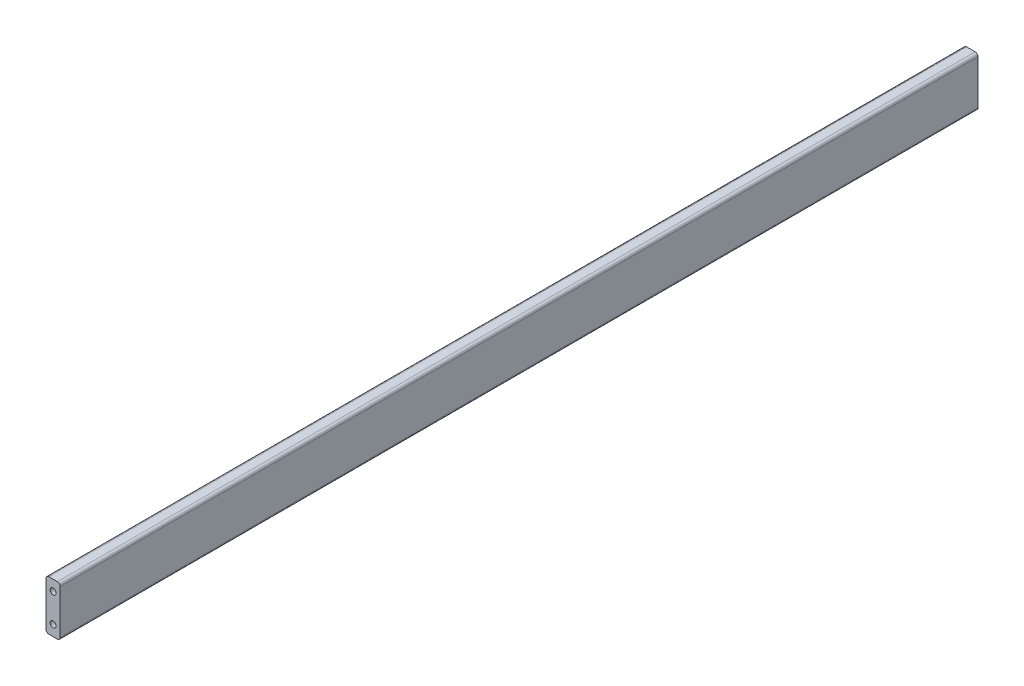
ISO-10303-21;
HEADER;
FILE_DESCRIPTION(('STEP AP214'),'2;1');
FILE_NAME('part.step','',(''),(''),'','','');
FILE_SCHEMA(('AUTOMOTIVE_DESIGN { 1 0 10303 214 1 1 1 1 }'));
ENDSEC;
DATA;
#1=APPLICATION_CONTEXT('core data for automotive mechanical design processes');
#2=APPLICATION_PROTOCOL_DEFINITION('international standard','automotive_design',2000,#1);
#3=PRODUCT_CONTEXT('',#1,'mechanical');
#4=PRODUCT('Part','Part','',(#3));
#5=PRODUCT_RELATED_PRODUCT_CATEGORY('part','',(#4));
#6=PRODUCT_DEFINITION_FORMATION('','',#4);
#7=PRODUCT_DEFINITION_CONTEXT('part definition',#1,'design');
#8=PRODUCT_DEFINITION('design','',#6,#7);
#9=PRODUCT_DEFINITION_SHAPE('','',#8);
#10=(LENGTH_UNIT() NAMED_UNIT(*) SI_UNIT(.MILLI.,.METRE.));
#11=(NAMED_UNIT(*) PLANE_ANGLE_UNIT() SI_UNIT($,.RADIAN.));
#12=(NAMED_UNIT(*) SI_UNIT($,.STERADIAN.) SOLID_ANGLE_UNIT());
#13=UNCERTAINTY_MEASURE_WITH_UNIT(LENGTH_MEASURE(1.E-05),#10,'distance_accuracy_value','');
#14=(GEOMETRIC_REPRESENTATION_CONTEXT(3) GLOBAL_UNCERTAINTY_ASSIGNED_CONTEXT((#13)) GLOBAL_UNIT_ASSIGNED_CONTEXT((#10,
#11,#12)) REPRESENTATION_CONTEXT('',''));
#15=CARTESIAN_POINT('',(0.,0.,0.));
#16=DIRECTION('',(0.,0.,1.));
#17=DIRECTION('',(1.,0.,0.));
#18=AXIS2_PLACEMENT_3D('',#15,#16,#17);
#19=CARTESIAN_POINT('',(0.,10.,308.499999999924));
#20=DIRECTION('',(0.,0.,1.));
#21=DIRECTION('',(1.,0.,0.));
#22=AXIS2_PLACEMENT_3D('',#19,#20,#21);
#23=CONICAL_SURFACE('',#22,2.09999999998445,1.04719755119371);
#24=CARTESIAN_POINT('',(5.6843418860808E-11,10.,307.287564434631));
#25=VERTEX_POINT('',#24);
#26=VERTEX_LOOP('',#25);
#27=FACE_BOUND('',#26,.T.);
#28=CARTESIAN_POINT('',(0.,10.,308.5));
#29=DIRECTION('',(0.,0.,1.));
#30=DIRECTION('',(1.,0.,0.));
#31=AXIS2_PLACEMENT_3D('',#28,#29,#30);
#32=CIRCLE('',#31,2.09999999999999);
#33=CARTESIAN_POINT('',(2.09999999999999,10.,308.5));
#34=VERTEX_POINT('',#33);
#35=EDGE_CURVE('E175',#34,#34,#32,.T.);
#36=ORIENTED_EDGE('',*,*,#35,.T.);
#37=EDGE_LOOP('',(#36));
#38=FACE_BOUND('',#37,.T.);
#39=ADVANCED_FACE('F16',(#27,#38),#23,.F.);
#40=CARTESIAN_POINT('',(0.,-10.,308.499999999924));
#41=DIRECTION('',(0.,0.,1.));
#42=DIRECTION('',(1.,0.,0.));
#43=AXIS2_PLACEMENT_3D('',#40,#41,#42);
#44=CONICAL_SURFACE('',#43,2.09999999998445,1.04719755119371);
#45=CARTESIAN_POINT('',(5.6843418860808E-11,-10.,307.287564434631));
#46=VERTEX_POINT('',#45);
#47=VERTEX_LOOP('',#46);
#48=FACE_BOUND('',#47,.T.);
#49=CARTESIAN_POINT('',(0.,-10.,308.5));
#50=DIRECTION('',(0.,0.,1.));
#51=DIRECTION('',(1.,0.,0.));
#52=AXIS2_PLACEMENT_3D('',#49,#50,#51);
#53=CIRCLE('',#52,2.09999999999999);
#54=CARTESIAN_POINT('',(2.09999999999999,-10.,308.5));
#55=VERTEX_POINT('',#54);
#56=EDGE_CURVE('E172',#55,#55,#53,.T.);
#57=ORIENTED_EDGE('',*,*,#56,.T.);
#58=EDGE_LOOP('',(#57));
#59=FACE_BOUND('',#58,.T.);
#60=ADVANCED_FACE('F351',(#48,#59),#44,.F.);
#61=CARTESIAN_POINT('',(0.,10.,-308.500000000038));
#62=DIRECTION('',(0.,0.,-1.));
#63=DIRECTION('',(-1.,0.,0.));
#64=AXIS2_PLACEMENT_3D('',#61,#62,#63);
#65=CONICAL_SURFACE('',#64,2.10000000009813,1.04719755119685);
#66=CARTESIAN_POINT('',(1.4210854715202E-10,10.,-307.287564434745));
#67=VERTEX_POINT('',#66);
#68=VERTEX_LOOP('',#67);
#69=FACE_BOUND('',#68,.T.);
#70=CARTESIAN_POINT('',(0.,10.,-308.5));
#71=DIRECTION('',(0.,0.,-1.));
#72=DIRECTION('',(-1.,0.,0.));
#73=AXIS2_PLACEMENT_3D('',#70,#71,#72);
#74=CIRCLE('',#73,2.1);
#75=CARTESIAN_POINT('',(-2.1,10.,-308.5));
#76=VERTEX_POINT('',#75);
#77=EDGE_CURVE('E169',#76,#76,#74,.T.);
#78=ORIENTED_EDGE('',*,*,#77,.T.);
#79=EDGE_LOOP('',(#78));
#80=FACE_BOUND('',#79,.T.);
#81=ADVANCED_FACE('F343',(#69,#80),#65,.F.);
#82=CARTESIAN_POINT('',(0.,-10.,-308.500000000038));
#83=DIRECTION('',(0.,0.,-1.));
#84=DIRECTION('',(-1.,0.,0.));
#85=AXIS2_PLACEMENT_3D('',#82,#83,#84);
#86=CONICAL_SURFACE('',#85,2.10000000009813,1.04719755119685);
#87=CARTESIAN_POINT('',(1.4210854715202E-10,-10.,-307.287564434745));
#88=VERTEX_POINT('',#87);
#89=VERTEX_LOOP('',#88);
#90=FACE_BOUND('',#89,.T.);
#91=CARTESIAN_POINT('',(0.,-10.,-308.5));
#92=DIRECTION('',(0.,0.,-1.));
#93=DIRECTION('',(-1.,0.,0.));
#94=AXIS2_PLACEMENT_3D('',#91,#92,#93);
#95=CIRCLE('',#94,2.1);
#96=CARTESIAN_POINT('',(-2.1,-10.,-308.5));
#97=VERTEX_POINT('',#96);
#98=EDGE_CURVE('E165',#97,#97,#95,.T.);
#99=ORIENTED_EDGE('',*,*,#98,.T.);
#100=EDGE_LOOP('',(#99));
#101=FACE_BOUND('',#100,.T.);
#102=ADVANCED_FACE('F332',(#90,#101),#86,.F.);
#103=CARTESIAN_POINT('',(0.,10.,322.5));
#104=DIRECTION('',(0.,0.,1.));
#105=DIRECTION('',(1.,0.,0.));
#106=AXIS2_PLACEMENT_3D('',#103,#104,#105);
#107=CYLINDRICAL_SURFACE('',#106,2.09999999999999);
#108=CARTESIAN_POINT('',(0.,10.,322.5));
#109=DIRECTION('',(0.,0.,1.));
#110=DIRECTION('',(1.,0.,0.));
#111=AXIS2_PLACEMENT_3D('',#108,#109,#110);
#112=CIRCLE('',#111,2.09999999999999);
#113=CARTESIAN_POINT('',(2.09999999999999,10.,322.5));
#114=VERTEX_POINT('',#113);
#115=EDGE_CURVE('E19',#114,#114,#112,.F.);
#116=ORIENTED_EDGE('',*,*,#115,.F.);
#117=EDGE_LOOP('',(#116));
#118=FACE_BOUND('',#117,.T.);
#119=ORIENTED_EDGE('',*,*,#35,.F.);
#120=EDGE_LOOP('',(#119));
#121=FACE_BOUND('',#120,.T.);
#122=ADVANCED_FACE('F322',(#118,#121),#107,.F.);
#123=CARTESIAN_POINT('',(0.,-10.,322.5));
#124=DIRECTION('',(0.,0.,1.));
#125=DIRECTION('',(1.,0.,0.));
#126=AXIS2_PLACEMENT_3D('',#123,#124,#125);
#127=CYLINDRICAL_SURFACE('',#126,2.09999999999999);
#128=CARTESIAN_POINT('',(0.,-10.,322.5));
#129=DIRECTION('',(0.,0.,1.));
#130=DIRECTION('',(1.,0.,0.));
#131=AXIS2_PLACEMENT_3D('',#128,#129,#130);
#132=CIRCLE('',#131,2.09999999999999);
#133=CARTESIAN_POINT('',(2.09999999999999,-10.,322.5));
#134=VERTEX_POINT('',#133);
#135=EDGE_CURVE('E145',#134,#134,#132,.F.);
#136=ORIENTED_EDGE('',*,*,#135,.F.);
#137=EDGE_LOOP('',(#136));
#138=FACE_BOUND('',#137,.T.);
#139=ORIENTED_EDGE('',*,*,#56,.F.);
#140=EDGE_LOOP('',(#139));
#141=FACE_BOUND('',#140,.T.);
#142=ADVANCED_FACE('F312',(#138,#141),#127,.F.);
#143=CARTESIAN_POINT('',(0.,10.,-322.5));
#144=DIRECTION('',(0.,0.,-1.));
#145=DIRECTION('',(-1.,0.,0.));
#146=AXIS2_PLACEMENT_3D('',#143,#144,#145);
#147=CYLINDRICAL_SURFACE('',#146,2.1);
#148=ORIENTED_EDGE('',*,*,#77,.F.);
#149=EDGE_LOOP('',(#148));
#150=FACE_BOUND('',#149,.T.);
#151=CARTESIAN_POINT('',(0.,10.,-322.5));
#152=DIRECTION('',(0.,0.,-1.));
#153=DIRECTION('',(-1.,0.,0.));
#154=AXIS2_PLACEMENT_3D('',#151,#152,#153);
#155=CIRCLE('',#154,2.1);
#156=CARTESIAN_POINT('',(-2.1,10.,-322.5));
#157=VERTEX_POINT('',#156);
#158=EDGE_CURVE('E131',#157,#157,#155,.T.);
#159=ORIENTED_EDGE('',*,*,#158,.T.);
#160=EDGE_LOOP('',(#159));
#161=FACE_BOUND('',#160,.T.);
#162=ADVANCED_FACE('F215',(#150,#161),#147,.F.);
#163=CARTESIAN_POINT('',(0.,-10.,-322.5));
#164=DIRECTION('',(0.,0.,-1.));
#165=DIRECTION('',(-1.,0.,0.));
#166=AXIS2_PLACEMENT_3D('',#163,#164,#165);
#167=CYLINDRICAL_SURFACE('',#166,2.1);
#168=ORIENTED_EDGE('',*,*,#98,.F.);
#169=EDGE_LOOP('',(#168));
#170=FACE_BOUND('',#169,.T.);
#171=CARTESIAN_POINT('',(0.,-10.,-322.5));
#172=DIRECTION('',(0.,0.,-1.));
#173=DIRECTION('',(-1.,0.,0.));
#174=AXIS2_PLACEMENT_3D('',#171,#172,#173);
#175=CIRCLE('',#174,2.1);
#176=CARTESIAN_POINT('',(-2.1,-10.,-322.5));
#177=VERTEX_POINT('',#176);
#178=EDGE_CURVE('E128',#177,#177,#175,.T.);
#179=ORIENTED_EDGE('',*,*,#178,.T.);
#180=EDGE_LOOP('',(#179));
#181=FACE_BOUND('',#180,.T.);
#182=ADVANCED_FACE('F207',(#170,#181),#167,.F.);
#183=CARTESIAN_POINT('',(-2.99999999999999,17.5,322.5));
#184=DIRECTION('',(0.,-1.,0.));
#185=DIRECTION('',(0.,0.,-1.));
#186=AXIS2_PLACEMENT_3D('',#183,#184,#185);
#187=PLANE('',#186);
#188=DIRECTION('',(0.,0.,-1.));
#189=VECTOR('',#188,1.);
#190=CARTESIAN_POINT('',(-2.99999999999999,17.5,322.5));
#191=LINE('',#190,#189);
#192=CARTESIAN_POINT('',(-2.99999999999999,17.5,322.5));
#193=VERTEX_POINT('',#192);
#194=CARTESIAN_POINT('',(-2.99999999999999,17.5,-322.5));
#195=VERTEX_POINT('',#194);
#196=EDGE_CURVE('E96',#193,#195,#191,.T.);
#197=ORIENTED_EDGE('',*,*,#196,.F.);
#198=DIRECTION('',(1.,0.,0.));
#199=VECTOR('',#198,1.);
#200=CARTESIAN_POINT('',(3.,17.5,322.5));
#201=LINE('',#200,#199);
#202=CARTESIAN_POINT('',(3.,17.5,322.5));
#203=VERTEX_POINT('',#202);
#204=EDGE_CURVE('E142',#203,#193,#201,.F.);
#205=ORIENTED_EDGE('',*,*,#204,.F.);
#206=DIRECTION('',(0.,0.,-1.));
#207=VECTOR('',#206,1.);
#208=CARTESIAN_POINT('',(3.,17.5,322.5));
#209=LINE('',#208,#207);
#210=CARTESIAN_POINT('',(3.,17.5,-322.5));
#211=VERTEX_POINT('',#210);
#212=EDGE_CURVE('E136',#211,#203,#209,.F.);
#213=ORIENTED_EDGE('',*,*,#212,.F.);
#214=DIRECTION('',(1.,0.,0.));
#215=VECTOR('',#214,1.);
#216=CARTESIAN_POINT('',(3.,17.5,-322.5));
#217=LINE('',#216,#215);
#218=EDGE_CURVE('E121',#211,#195,#217,.F.);
#219=ORIENTED_EDGE('',*,*,#218,.T.);
#220=EDGE_LOOP('',(#197,#205,#213,#219));
#221=FACE_BOUND('',#220,.T.);
#222=ADVANCED_FACE('F205',(#221),#187,.F.);
#223=CARTESIAN_POINT('',(-3.,15.5,322.5));
#224=DIRECTION('',(0.,0.,-1.));
#225=DIRECTION('',(-1.,0.,0.));
#226=AXIS2_PLACEMENT_3D('',#223,#224,#225);
#227=CYLINDRICAL_SURFACE('',#226,2.00000000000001);
#228=CARTESIAN_POINT('',(-3.,15.5,322.5));
#229=DIRECTION('',(0.,0.,-1.));
#230=DIRECTION('',(-1.,0.,0.));
#231=AXIS2_PLACEMENT_3D('',#228,#229,#230);
#232=CIRCLE('',#231,2.00000000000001);
#233=CARTESIAN_POINT('',(-5.,15.5,322.5));
#234=VERTEX_POINT('',#233);
#235=EDGE_CURVE('E140',#193,#234,#232,.F.);
#236=ORIENTED_EDGE('',*,*,#235,.F.);
#237=ORIENTED_EDGE('',*,*,#196,.T.);
#238=CARTESIAN_POINT('',(-3.,15.5,-322.5));
#239=DIRECTION('',(0.,0.,-1.));
#240=DIRECTION('',(-1.,0.,0.));
#241=AXIS2_PLACEMENT_3D('',#238,#239,#240);
#242=CIRCLE('',#241,2.00000000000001);
#243=CARTESIAN_POINT('',(-5.,15.5,-322.5));
#244=VERTEX_POINT('',#243);
#245=EDGE_CURVE('E115',#195,#244,#242,.F.);
#246=ORIENTED_EDGE('',*,*,#245,.T.);
#247=DIRECTION('',(0.,0.,1.));
#248=VECTOR('',#247,1.);
#249=CARTESIAN_POINT('',(-5.,15.5,322.5));
#250=LINE('',#249,#248);
#251=EDGE_CURVE('E103',#244,#234,#250,.T.);
#252=ORIENTED_EDGE('',*,*,#251,.T.);
#253=EDGE_LOOP('',(#236,#237,#246,#252));
#254=FACE_BOUND('',#253,.T.);
#255=ADVANCED_FACE('F120',(#254),#227,.T.);
#256=CARTESIAN_POINT('',(-5.,15.5,322.5));
#257=DIRECTION('',(1.,0.,0.));
#258=DIRECTION('',(0.,1.,0.));
#259=AXIS2_PLACEMENT_3D('',#256,#257,#258);
#260=PLANE('',#259);
#261=DIRECTION('',(0.,0.,-1.));
#262=VECTOR('',#261,1.);
#263=CARTESIAN_POINT('',(-5.,-15.5,322.5));
#264=LINE('',#263,#262);
#265=CARTESIAN_POINT('',(-5.,-15.5,322.5));
#266=VERTEX_POINT('',#265);
#267=CARTESIAN_POINT('',(-5.,-15.5,-322.5));
#268=VERTEX_POINT('',#267);
#269=EDGE_CURVE('E109',#266,#268,#264,.T.);
#270=ORIENTED_EDGE('',*,*,#269,.F.);
#271=DIRECTION('',(0.,1.,0.));
#272=VECTOR('',#271,1.);
#273=CARTESIAN_POINT('',(-5.,-15.5,322.5));
#274=LINE('',#273,#272);
#275=EDGE_CURVE('E108',#234,#266,#274,.F.);
#276=ORIENTED_EDGE('',*,*,#275,.F.);
#277=ORIENTED_EDGE('',*,*,#251,.F.);
#278=DIRECTION('',(0.,1.,0.));
#279=VECTOR('',#278,1.);
#280=CARTESIAN_POINT('',(-5.,-15.5,-322.5));
#281=LINE('',#280,#279);
#282=EDGE_CURVE('E107',#244,#268,#281,.F.);
#283=ORIENTED_EDGE('',*,*,#282,.T.);
#284=EDGE_LOOP('',(#270,#276,#277,#283));
#285=FACE_BOUND('',#284,.T.);
#286=ADVANCED_FACE('F106',(#285),#260,.F.);
#287=CARTESIAN_POINT('',(-3.,-15.5,322.5));
#288=DIRECTION('',(0.,0.,-1.));
#289=DIRECTION('',(-1.,0.,0.));
#290=AXIS2_PLACEMENT_3D('',#287,#288,#289);
#291=CYLINDRICAL_SURFACE('',#290,2.);
#292=CARTESIAN_POINT('',(-3.,-15.5,322.5));
#293=DIRECTION('',(0.,0.,-1.));
#294=DIRECTION('',(-1.,0.,0.));
#295=AXIS2_PLACEMENT_3D('',#292,#293,#294);
#296=CIRCLE('',#295,2.);
#297=CARTESIAN_POINT('',(-2.99999999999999,-17.5,322.5));
#298=VERTEX_POINT('',#297);
#299=EDGE_CURVE('E137',#266,#298,#296,.F.);
#300=ORIENTED_EDGE('',*,*,#299,.F.);
#301=ORIENTED_EDGE('',*,*,#269,.T.);
#302=CARTESIAN_POINT('',(-3.,-15.5,-322.5));
#303=DIRECTION('',(0.,0.,-1.));
#304=DIRECTION('',(-1.,0.,0.));
#305=AXIS2_PLACEMENT_3D('',#302,#303,#304);
#306=CIRCLE('',#305,2.);
#307=CARTESIAN_POINT('',(-2.99999999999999,-17.5,-322.5));
#308=VERTEX_POINT('',#307);
#309=EDGE_CURVE('E118',#268,#308,#306,.F.);
#310=ORIENTED_EDGE('',*,*,#309,.T.);
#311=DIRECTION('',(0.,0.,1.));
#312=VECTOR('',#311,1.);
#313=CARTESIAN_POINT('',(-2.99999999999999,-17.5,322.5));
#314=LINE('',#313,#312);
#315=EDGE_CURVE('E152',#308,#298,#314,.T.);
#316=ORIENTED_EDGE('',*,*,#315,.T.);
#317=EDGE_LOOP('',(#300,#301,#310,#316));
#318=FACE_BOUND('',#317,.T.);
#319=ADVANCED_FACE('F193',(#318),#291,.T.);
#320=CARTESIAN_POINT('',(-2.99999999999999,-17.5,322.5));
#321=DIRECTION('',(0.,1.,0.));
#322=DIRECTION('',(0.,0.,1.));
#323=AXIS2_PLACEMENT_3D('',#320,#321,#322);
#324=PLANE('',#323);
#325=DIRECTION('',(0.,0.,-1.));
#326=VECTOR('',#325,1.);
#327=CARTESIAN_POINT('',(3.,-17.5,322.5));
#328=LINE('',#327,#326);
#329=CARTESIAN_POINT('',(3.,-17.5,322.5));
#330=VERTEX_POINT('',#329);
#331=CARTESIAN_POINT('',(3.,-17.5,-322.5));
#332=VERTEX_POINT('',#331);
#333=EDGE_CURVE('E66',#330,#332,#328,.T.);
#334=ORIENTED_EDGE('',*,*,#333,.F.);
#335=DIRECTION('',(1.,0.,0.));
#336=VECTOR('',#335,1.);
#337=CARTESIAN_POINT('',(3.,-17.5,322.5));
#338=LINE('',#337,#336);
#339=EDGE_CURVE('E139',#298,#330,#338,.T.);
#340=ORIENTED_EDGE('',*,*,#339,.F.);
#341=ORIENTED_EDGE('',*,*,#315,.F.);
#342=DIRECTION('',(1.,0.,0.));
#343=VECTOR('',#342,1.);
#344=CARTESIAN_POINT('',(3.,-17.5,-322.5));
#345=LINE('',#344,#343);
#346=EDGE_CURVE('E179',#308,#332,#345,.T.);
#347=ORIENTED_EDGE('',*,*,#346,.T.);
#348=EDGE_LOOP('',(#334,#340,#341,#347));
#349=FACE_BOUND('',#348,.T.);
#350=ADVANCED_FACE('F194',(#349),#324,.F.);
#351=CARTESIAN_POINT('',(3.,-15.5,322.5));
#352=DIRECTION('',(0.,0.,-1.));
#353=DIRECTION('',(-1.,0.,0.));
#354=AXIS2_PLACEMENT_3D('',#351,#352,#353);
#355=CYLINDRICAL_SURFACE('',#354,2.);
#356=CARTESIAN_POINT('',(3.,-15.5,322.5));
#357=DIRECTION('',(0.,0.,-1.));
#358=DIRECTION('',(-1.,0.,0.));
#359=AXIS2_PLACEMENT_3D('',#356,#357,#358);
#360=CIRCLE('',#359,2.);
#361=CARTESIAN_POINT('',(5.,-15.5,322.5));
#362=VERTEX_POINT('',#361);
#363=EDGE_CURVE('E143',#330,#362,#360,.F.);
#364=ORIENTED_EDGE('',*,*,#363,.F.);
#365=ORIENTED_EDGE('',*,*,#333,.T.);
#366=CARTESIAN_POINT('',(3.,-15.5,-322.5));
#367=DIRECTION('',(0.,0.,-1.));
#368=DIRECTION('',(-1.,0.,0.));
#369=AXIS2_PLACEMENT_3D('',#366,#367,#368);
#370=CIRCLE('',#369,2.);
#371=CARTESIAN_POINT('',(5.,-15.5,-322.5));
#372=VERTEX_POINT('',#371);
#373=EDGE_CURVE('E177',#332,#372,#370,.F.);
#374=ORIENTED_EDGE('',*,*,#373,.T.);
#375=DIRECTION('',(0.,0.,1.));
#376=VECTOR('',#375,1.);
#377=CARTESIAN_POINT('',(5.,-15.5,322.5));
#378=LINE('',#377,#376);
#379=EDGE_CURVE('E178',#372,#362,#378,.T.);
#380=ORIENTED_EDGE('',*,*,#379,.T.);
#381=EDGE_LOOP('',(#364,#365,#374,#380));
#382=FACE_BOUND('',#381,.T.);
#383=ADVANCED_FACE('F196',(#382),#355,.T.);
#384=CARTESIAN_POINT('',(3.,-15.5,322.5));
#385=DIRECTION('',(0.,0.,1.));
#386=DIRECTION('',(1.,0.,0.));
#387=AXIS2_PLACEMENT_3D('',#384,#385,#386);
#388=PLANE('',#387);
#389=ORIENTED_EDGE('',*,*,#299,.T.);
#390=ORIENTED_EDGE('',*,*,#339,.T.);
#391=ORIENTED_EDGE('',*,*,#363,.T.);
#392=DIRECTION('',(0.,1.,0.));
#393=VECTOR('',#392,1.);
#394=CARTESIAN_POINT('',(5.,15.5,322.5));
#395=LINE('',#394,#393);
#396=CARTESIAN_POINT('',(5.,15.5,322.5));
#397=VERTEX_POINT('',#396);
#398=EDGE_CURVE('E181',#362,#397,#395,.T.);
#399=ORIENTED_EDGE('',*,*,#398,.T.);
#400=CARTESIAN_POINT('',(3.,15.5,322.5));
#401=DIRECTION('',(0.,0.,-1.));
#402=DIRECTION('',(-1.,0.,0.));
#403=AXIS2_PLACEMENT_3D('',#400,#401,#402);
#404=CIRCLE('',#403,2.00000000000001);
#405=EDGE_CURVE('E134',#203,#397,#404,.T.);
#406=ORIENTED_EDGE('',*,*,#405,.F.);
#407=ORIENTED_EDGE('',*,*,#204,.T.);
#408=ORIENTED_EDGE('',*,*,#235,.T.);
#409=ORIENTED_EDGE('',*,*,#275,.T.);
#410=EDGE_LOOP('',(#389,#390,#391,#399,#406,#407,#408,#409));
#411=FACE_BOUND('',#410,.T.);
#412=ORIENTED_EDGE('',*,*,#135,.T.);
#413=EDGE_LOOP('',(#412));
#414=FACE_BOUND('',#413,.T.);
#415=ORIENTED_EDGE('',*,*,#115,.T.);
#416=EDGE_LOOP('',(#415));
#417=FACE_BOUND('',#416,.T.);
#418=ADVANCED_FACE('F190',(#411,#414,#417),#388,.T.);
#419=CARTESIAN_POINT('',(3.,15.5,322.5));
#420=DIRECTION('',(0.,0.,-1.));
#421=DIRECTION('',(-1.,0.,0.));
#422=AXIS2_PLACEMENT_3D('',#419,#420,#421);
#423=CYLINDRICAL_SURFACE('',#422,2.00000000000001);
#424=ORIENTED_EDGE('',*,*,#405,.T.);
#425=DIRECTION('',(0.,0.,1.));
#426=VECTOR('',#425,1.);
#427=CARTESIAN_POINT('',(5.,15.5,322.5));
#428=LINE('',#427,#426);
#429=CARTESIAN_POINT('',(5.,15.5,-322.5));
#430=VERTEX_POINT('',#429);
#431=EDGE_CURVE('E25',#397,#430,#428,.F.);
#432=ORIENTED_EDGE('',*,*,#431,.T.);
#433=CARTESIAN_POINT('',(3.,15.5,-322.5));
#434=DIRECTION('',(0.,0.,-1.));
#435=DIRECTION('',(-1.,0.,0.));
#436=AXIS2_PLACEMENT_3D('',#433,#434,#435);
#437=CIRCLE('',#436,2.00000000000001);
#438=EDGE_CURVE('E33',#430,#211,#437,.F.);
#439=ORIENTED_EDGE('',*,*,#438,.T.);
#440=ORIENTED_EDGE('',*,*,#212,.T.);
#441=EDGE_LOOP('',(#424,#432,#439,#440));
#442=FACE_BOUND('',#441,.T.);
#443=ADVANCED_FACE('F203',(#442),#423,.T.);
#444=CARTESIAN_POINT('',(3.,-15.5,-322.5));
#445=DIRECTION('',(0.,0.,1.));
#446=DIRECTION('',(1.,0.,0.));
#447=AXIS2_PLACEMENT_3D('',#444,#445,#446);
#448=PLANE('',#447);
#449=ORIENTED_EDGE('',*,*,#346,.F.);
#450=ORIENTED_EDGE('',*,*,#309,.F.);
#451=ORIENTED_EDGE('',*,*,#282,.F.);
#452=ORIENTED_EDGE('',*,*,#245,.F.);
#453=ORIENTED_EDGE('',*,*,#218,.F.);
#454=ORIENTED_EDGE('',*,*,#438,.F.);
#455=DIRECTION('',(0.,1.,0.));
#456=VECTOR('',#455,1.);
#457=CARTESIAN_POINT('',(5.,15.5,-322.5));
#458=LINE('',#457,#456);
#459=EDGE_CURVE('E11',#430,#372,#458,.F.);
#460=ORIENTED_EDGE('',*,*,#459,.T.);
#461=ORIENTED_EDGE('',*,*,#373,.F.);
#462=EDGE_LOOP('',(#449,#450,#451,#452,#453,#454,#460,#461));
#463=FACE_BOUND('',#462,.T.);
#464=ORIENTED_EDGE('',*,*,#178,.F.);
#465=EDGE_LOOP('',(#464));
#466=FACE_BOUND('',#465,.T.);
#467=ORIENTED_EDGE('',*,*,#158,.F.);
#468=EDGE_LOOP('',(#467));
#469=FACE_BOUND('',#468,.T.);
#470=ADVANCED_FACE('F113',(#463,#466,#469),#448,.F.);
#471=CARTESIAN_POINT('',(5.,15.5,322.5));
#472=DIRECTION('',(-1.,0.,0.));
#473=DIRECTION('',(0.,0.,1.));
#474=AXIS2_PLACEMENT_3D('',#471,#472,#473);
#475=PLANE('',#474);
#476=ORIENTED_EDGE('',*,*,#431,.F.);
#477=ORIENTED_EDGE('',*,*,#398,.F.);
#478=ORIENTED_EDGE('',*,*,#379,.F.);
#479=ORIENTED_EDGE('',*,*,#459,.F.);
#480=EDGE_LOOP('',(#476,#477,#478,#479));
#481=FACE_BOUND('',#480,.T.);
#482=ADVANCED_FACE('F199',(#481),#475,.F.);
#483=CLOSED_SHELL('',(#39,#60,#81,#102,#122,#142,#162,#182,#222,#255,#286,#319,#350,#383,#418,
#443,#470,#482));
#484=MANIFOLD_SOLID_BREP('B1',#483);
#485=ADVANCED_BREP_SHAPE_REPRESENTATION('',(#18,#484),#14);
#486=SHAPE_DEFINITION_REPRESENTATION(#9,#485);
ENDSEC;
END-ISO-10303-21;
